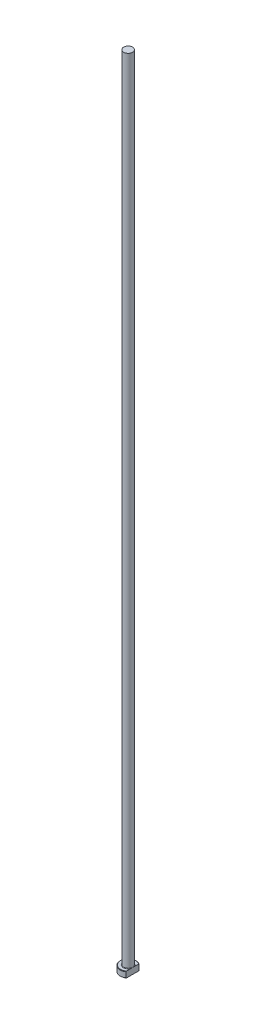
ISO-10303-21;
HEADER;
FILE_DESCRIPTION(('STEP AP214'),'2;1');
FILE_NAME('part.step','',(''),(''),'','','');
FILE_SCHEMA(('AUTOMOTIVE_DESIGN { 1 0 10303 214 1 1 1 1 }'));
ENDSEC;
DATA;
#1=APPLICATION_CONTEXT('core data for automotive mechanical design processes');
#2=APPLICATION_PROTOCOL_DEFINITION('international standard','automotive_design',2000,#1);
#3=PRODUCT_CONTEXT('',#1,'mechanical');
#4=PRODUCT('Part','Part','',(#3));
#5=PRODUCT_RELATED_PRODUCT_CATEGORY('part','',(#4));
#6=PRODUCT_DEFINITION_FORMATION('','',#4);
#7=PRODUCT_DEFINITION_CONTEXT('part definition',#1,'design');
#8=PRODUCT_DEFINITION('design','',#6,#7);
#9=PRODUCT_DEFINITION_SHAPE('','',#8);
#10=(LENGTH_UNIT() NAMED_UNIT(*) SI_UNIT(.MILLI.,.METRE.));
#11=(NAMED_UNIT(*) PLANE_ANGLE_UNIT() SI_UNIT($,.RADIAN.));
#12=(NAMED_UNIT(*) SI_UNIT($,.STERADIAN.) SOLID_ANGLE_UNIT());
#13=UNCERTAINTY_MEASURE_WITH_UNIT(LENGTH_MEASURE(1.E-05),#10,'distance_accuracy_value','');
#14=(GEOMETRIC_REPRESENTATION_CONTEXT(3) GLOBAL_UNCERTAINTY_ASSIGNED_CONTEXT((#13)) GLOBAL_UNIT_ASSIGNED_CONTEXT((#10,
#11,#12)) REPRESENTATION_CONTEXT('',''));
#15=CARTESIAN_POINT('',(0.,0.,0.));
#16=DIRECTION('',(0.,0.,1.));
#17=DIRECTION('',(1.,0.,0.));
#18=AXIS2_PLACEMENT_3D('',#15,#16,#17);
#19=CARTESIAN_POINT('',(0.,0.,0.));
#20=DIRECTION('',(0.,-1.,0.));
#21=DIRECTION('',(0.,0.,-1.));
#22=AXIS2_PLACEMENT_3D('',#19,#20,#21);
#23=PLANE('',#22);
#24=CARTESIAN_POINT('',(0.,0.,0.));
#25=DIRECTION('',(0.,-1.,0.));
#26=DIRECTION('',(0.,0.,-1.));
#27=AXIS2_PLACEMENT_3D('',#24,#25,#26);
#28=CIRCLE('',#27,3.80000000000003);
#29=CARTESIAN_POINT('',(2.24999999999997,0.,3.06227039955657));
#30=VERTEX_POINT('',#29);
#31=CARTESIAN_POINT('',(2.24999999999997,0.,-3.06227039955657));
#32=VERTEX_POINT('',#31);
#33=EDGE_CURVE('E98',#30,#32,#28,.T.);
#34=ORIENTED_EDGE('',*,*,#33,.T.);
#35=DIRECTION('',(0.,0.,1.));
#36=VECTOR('',#35,1.);
#37=CARTESIAN_POINT('',(2.24999999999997,0.,-3.30718913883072));
#38=LINE('',#37,#36);
#39=EDGE_CURVE('E83',#32,#30,#38,.T.);
#40=ORIENTED_EDGE('',*,*,#39,.T.);
#41=EDGE_LOOP('',(#34,#40));
#42=FACE_BOUND('',#41,.T.);
#43=ADVANCED_FACE('F32',(#42),#23,.T.);
#44=CARTESIAN_POINT('',(0.,259.958771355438,0.));
#45=DIRECTION('',(0.,1.,0.));
#46=DIRECTION('',(0.,0.,1.));
#47=AXIS2_PLACEMENT_3D('',#44,#45,#46);
#48=CYLINDRICAL_SURFACE('',#47,3.99999999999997);
#49=CARTESIAN_POINT('',(0.,2.80000000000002,0.));
#50=DIRECTION('',(0.,1.,0.));
#51=DIRECTION('',(0.,0.,1.));
#52=AXIS2_PLACEMENT_3D('',#49,#50,#51);
#53=CIRCLE('',#52,3.99999999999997);
#54=CARTESIAN_POINT('',(2.24999999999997,2.80000000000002,3.30718913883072));
#55=VERTEX_POINT('',#54);
#56=CARTESIAN_POINT('',(2.24999999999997,2.80000000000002,-3.30718913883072));
#57=VERTEX_POINT('',#56);
#58=EDGE_CURVE('E104',#55,#57,#53,.F.);
#59=ORIENTED_EDGE('',*,*,#58,.T.);
#60=DIRECTION('',(0.,-1.,0.));
#61=VECTOR('',#60,1.);
#62=CARTESIAN_POINT('',(2.24999999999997,400.,-3.30718913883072));
#63=LINE('',#62,#61);
#64=CARTESIAN_POINT('',(2.24999999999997,0.199999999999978,-3.30718913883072));
#65=VERTEX_POINT('',#64);
#66=EDGE_CURVE('E183',#57,#65,#63,.T.);
#67=ORIENTED_EDGE('',*,*,#66,.T.);
#68=CARTESIAN_POINT('',(0.,0.199999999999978,0.));
#69=DIRECTION('',(0.,-1.,0.));
#70=DIRECTION('',(0.,0.,-1.));
#71=AXIS2_PLACEMENT_3D('',#68,#69,#70);
#72=CIRCLE('',#71,3.99999999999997);
#73=CARTESIAN_POINT('',(2.24999999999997,0.199999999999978,3.30718913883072));
#74=VERTEX_POINT('',#73);
#75=EDGE_CURVE('E100',#65,#74,#72,.F.);
#76=ORIENTED_EDGE('',*,*,#75,.T.);
#77=DIRECTION('',(0.,-1.,0.));
#78=VECTOR('',#77,1.);
#79=CARTESIAN_POINT('',(2.24999999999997,400.,3.30718913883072));
#80=LINE('',#79,#78);
#81=EDGE_CURVE('E93',#55,#74,#80,.T.);
#82=ORIENTED_EDGE('',*,*,#81,.F.);
#83=EDGE_LOOP('',(#59,#67,#76,#82));
#84=FACE_BOUND('',#83,.T.);
#85=ADVANCED_FACE('F158',(#84),#48,.T.);
#86=CARTESIAN_POINT('',(-3.99999999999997,3.,0.));
#87=DIRECTION('',(0.,1.,0.));
#88=DIRECTION('',(0.,0.,1.));
#89=AXIS2_PLACEMENT_3D('',#86,#87,#88);
#90=PLANE('',#89);
#91=CARTESIAN_POINT('',(0.,3.,0.));
#92=DIRECTION('',(0.,1.,0.));
#93=DIRECTION('',(0.,0.,1.));
#94=AXIS2_PLACEMENT_3D('',#91,#92,#93);
#95=CIRCLE('',#94,3.80000000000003);
#96=CARTESIAN_POINT('',(2.24999999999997,3.,-3.06227039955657));
#97=VERTEX_POINT('',#96);
#98=CARTESIAN_POINT('',(2.24999999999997,3.,3.06227039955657));
#99=VERTEX_POINT('',#98);
#100=EDGE_CURVE('E178',#97,#99,#95,.T.);
#101=ORIENTED_EDGE('',*,*,#100,.T.);
#102=DIRECTION('',(0.,0.,-1.));
#103=VECTOR('',#102,1.);
#104=CARTESIAN_POINT('',(2.24999999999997,3.,0.));
#105=LINE('',#104,#103);
#106=CARTESIAN_POINT('',(2.24999999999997,2.99999999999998,0.969535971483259));
#107=VERTEX_POINT('',#106);
#108=EDGE_CURVE('E57',#99,#107,#105,.T.);
#109=ORIENTED_EDGE('',*,*,#108,.T.);
#110=CARTESIAN_POINT('',(0.,3.,0.));
#111=DIRECTION('',(0.,1.,0.));
#112=DIRECTION('',(0.,0.,1.));
#113=AXIS2_PLACEMENT_3D('',#110,#111,#112);
#114=CIRCLE('',#113,2.44999999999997);
#115=CARTESIAN_POINT('',(2.24999999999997,2.99999999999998,-0.969535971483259));
#116=VERTEX_POINT('',#115);
#117=EDGE_CURVE('E107',#107,#116,#114,.F.);
#118=ORIENTED_EDGE('',*,*,#117,.T.);
#119=EDGE_CURVE('E136',#116,#97,#105,.T.);
#120=ORIENTED_EDGE('',*,*,#119,.T.);
#121=EDGE_LOOP('',(#101,#109,#118,#120));
#122=FACE_BOUND('',#121,.T.);
#123=ADVANCED_FACE('F147',(#122),#90,.T.);
#124=CARTESIAN_POINT('',(0.,3.,0.));
#125=DIRECTION('',(0.,-1.,0.));
#126=DIRECTION('',(0.,0.,-1.));
#127=AXIS2_PLACEMENT_3D('',#124,#125,#126);
#128=CONICAL_SURFACE('',#127,3.80000000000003,0.785398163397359);
#129=ORIENTED_EDGE('',*,*,#58,.F.);
#130=CARTESIAN_POINT('',(2.24999999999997,-0.817697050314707,7.27782992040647));
#131=CARTESIAN_POINT('',(2.24999999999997,-0.691332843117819,7.14556140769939));
#132=CARTESIAN_POINT('',(2.24999999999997,-0.565122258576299,7.01314597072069));
#133=CARTESIAN_POINT('',(2.24999999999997,-0.31307114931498,6.74796170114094));
#134=CARTESIAN_POINT('',(2.24999999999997,-0.187230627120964,6.61519286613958));
#135=CARTESIAN_POINT('',(2.24999999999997,0.189705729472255,6.21619905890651));
#136=CARTESIAN_POINT('',(2.24999999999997,0.440149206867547,5.94935693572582));
#137=CARTESIAN_POINT('',(2.24999999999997,0.940260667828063,5.41146981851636));
#138=CARTESIAN_POINT('',(2.24999999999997,1.18991116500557,5.14040850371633));
#139=CARTESIAN_POINT('',(2.24999999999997,1.56140055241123,4.73113683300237));
#140=CARTESIAN_POINT('',(2.24999999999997,1.68472451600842,4.59427552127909));
#141=CARTESIAN_POINT('',(2.24999999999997,1.93009407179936,4.31941326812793));
#142=CARTESIAN_POINT('',(2.24999999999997,2.05213967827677,4.18141233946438));
#143=CARTESIAN_POINT('',(2.24999999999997,2.31419582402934,3.88150807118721));
#144=CARTESIAN_POINT('',(2.24999999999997,2.45391708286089,3.71935099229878));
#145=CARTESIAN_POINT('',(2.24999999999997,2.73025215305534,3.39234412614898));
#146=CARTESIAN_POINT('',(2.24999999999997,2.86686529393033,3.22749377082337));
#147=CARTESIAN_POINT('',(2.24999999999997,3.13534139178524,2.89430849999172));
#148=CARTESIAN_POINT('',(2.24999999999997,3.26721073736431,2.72597879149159));
#149=CARTESIAN_POINT('',(2.24999999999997,3.45966785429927,2.46950762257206));
#150=CARTESIAN_POINT('',(2.24999999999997,3.52291962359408,2.38336821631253));
#151=CARTESIAN_POINT('',(2.24999999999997,3.64714184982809,2.2094641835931));
#152=CARTESIAN_POINT('',(2.24999999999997,3.7081125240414,2.12169971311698));
#153=CARTESIAN_POINT('',(2.24999999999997,3.82102230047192,1.95327886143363));
#154=CARTESIAN_POINT('',(2.24999999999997,3.87324695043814,1.87281476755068));
#155=CARTESIAN_POINT('',(2.24999999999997,3.97467249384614,1.70998172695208));
#156=CARTESIAN_POINT('',(2.24999999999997,4.02387305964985,1.62761257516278));
#157=CARTESIAN_POINT('',(2.24999999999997,4.11837607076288,1.46059799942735));
#158=CARTESIAN_POINT('',(2.24999999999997,4.16367708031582,1.37595175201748));
#159=CARTESIAN_POINT('',(2.24999999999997,4.24914050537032,1.20413766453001));
#160=CARTESIAN_POINT('',(2.24999999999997,4.28930406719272,1.11697039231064));
#161=CARTESIAN_POINT('',(2.24999999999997,4.38314726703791,0.891175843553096));
#162=CARTESIAN_POINT('',(2.24999999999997,4.43219749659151,0.750488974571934));
#163=CARTESIAN_POINT('',(2.24999999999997,4.48826674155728,0.535159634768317));
#164=CARTESIAN_POINT('',(2.24999999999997,4.50402844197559,0.462776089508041));
#165=CARTESIAN_POINT('',(2.24999999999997,4.52893388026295,0.316860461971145));
#166=CARTESIAN_POINT('',(2.24999999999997,4.53807847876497,0.243328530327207));
#167=CARTESIAN_POINT('',(2.24999999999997,4.54922474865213,0.0949504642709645));
#168=CARTESIAN_POINT('',(2.24999999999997,4.55115152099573,0.0200986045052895));
#169=CARTESIAN_POINT('',(2.24999999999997,4.54752076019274,-0.129420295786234));
#170=CARTESIAN_POINT('',(2.24999999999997,4.54196316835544,-0.204087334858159));
#171=CARTESIAN_POINT('',(2.24999999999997,4.52372329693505,-0.352688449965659));
#172=CARTESIAN_POINT('',(2.24999999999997,4.51102617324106,-0.426620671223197));
#173=CARTESIAN_POINT('',(2.24999999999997,4.47926333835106,-0.573094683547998));
#174=CARTESIAN_POINT('',(2.24999999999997,4.46019612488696,-0.645636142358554));
#175=CARTESIAN_POINT('',(2.24999999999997,4.40610994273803,-0.823701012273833));
#176=CARTESIAN_POINT('',(2.24999999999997,4.36783449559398,-0.928230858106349));
#177=CARTESIAN_POINT('',(2.24999999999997,4.28232692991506,-1.13354070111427));
#178=CARTESIAN_POINT('',(2.24999999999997,4.23508812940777,-1.23431783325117));
#179=CARTESIAN_POINT('',(2.24999999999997,4.13380125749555,-1.43298762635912));
#180=CARTESIAN_POINT('',(2.24999999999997,4.07972026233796,-1.53086330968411));
#181=CARTESIAN_POINT('',(2.24999999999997,3.9949620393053,-1.67548648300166));
#182=CARTESIAN_POINT('',(2.24999999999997,3.96610811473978,-1.72332162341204));
#183=CARTESIAN_POINT('',(2.24999999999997,3.90734436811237,-1.81833709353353));
#184=CARTESIAN_POINT('',(2.24999999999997,3.87743458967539,-1.86551745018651));
#185=CARTESIAN_POINT('',(2.24999999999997,3.7750959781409,-2.02354622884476));
#186=CARTESIAN_POINT('',(2.24999999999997,3.70057106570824,-2.13303820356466));
#187=CARTESIAN_POINT('',(2.24999999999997,3.54784662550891,-2.34943854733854));
#188=CARTESIAN_POINT('',(2.24999999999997,3.46964624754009,-2.45634630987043));
#189=CARTESIAN_POINT('',(2.24999999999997,3.31046802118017,-2.66818697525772));
#190=CARTESIAN_POINT('',(2.24999999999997,3.22948822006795,-2.77311840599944));
#191=CARTESIAN_POINT('',(2.24999999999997,3.06545223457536,-2.98134898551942));
#192=CARTESIAN_POINT('',(2.24999999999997,2.98239592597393,-3.08464803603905));
#193=CARTESIAN_POINT('',(2.24999999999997,2.7304425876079,-3.39308007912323));
#194=CARTESIAN_POINT('',(2.24999999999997,2.55914389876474,-3.59624854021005));
#195=CARTESIAN_POINT('',(2.24999999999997,2.21260420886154,-3.99901521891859));
#196=CARTESIAN_POINT('',(2.24999999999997,2.03736490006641,-4.19861490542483));
#197=CARTESIAN_POINT('',(2.24999999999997,1.68403823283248,-4.59551245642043));
#198=CARTESIAN_POINT('',(2.24999999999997,1.50594904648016,-4.79280869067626));
#199=CARTESIAN_POINT('',(2.24999999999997,1.14782580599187,-5.18566037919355));
#200=CARTESIAN_POINT('',(2.24999999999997,0.967791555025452,-5.38121565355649));
#201=CARTESIAN_POINT('',(2.24999999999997,0.606519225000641,-5.77078870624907));
#202=CARTESIAN_POINT('',(2.24999999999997,0.425282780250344,-5.96480800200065));
#203=CARTESIAN_POINT('',(2.24999999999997,0.0617463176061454,-6.35184762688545));
#204=CARTESIAN_POINT('',(2.24999999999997,-0.120553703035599,-6.5448679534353));
#205=CARTESIAN_POINT('',(2.24999999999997,-0.38887673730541,-6.82775668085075));
#206=CARTESIAN_POINT('',(2.24999999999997,-0.474578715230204,-6.91792994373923));
#207=CARTESIAN_POINT('',(2.24999999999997,-0.64606226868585,-7.09803491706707));
#208=CARTESIAN_POINT('',(2.24999999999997,-0.731843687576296,-7.1879667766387));
#209=CARTESIAN_POINT('',(2.24999999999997,-0.817697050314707,-7.27782992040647));
#210=B_SPLINE_CURVE_WITH_KNOTS('',3,(#130,#131,#132,#133,#134,#135,#136,#137,#138,#139,#140,
#141,#142,#143,#144,#145,#146,#147,#148,#149,#150,#151,#152,#153,#154,#155,#156,#157,#158,#159,
#160,#161,#162,#163,#164,#165,#166,#167,#168,#169,#170,#171,#172,#173,#174,#175,#176,#177,#178,
#179,#180,#181,#182,#183,#184,#185,#186,#187,#188,#189,#190,#191,#192,#193,#194,#195,#196,#197,
#198,#199,#200,#201,#202,#203,#204,#205,#206,#207,#208,#209),.UNSPECIFIED.,.F.,.F.,(4,2,2,2,2,2,
2,2,2,2,2,2,2,2,2,2,2,2,2,2,2,2,2,2,2,2,2,2,2,2,2,2,2,2,2,2,2,2,2,4),(0.,0.548785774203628,
1.09757528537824,2.19544562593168,3.30094607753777,3.85362276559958,4.40629327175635,
5.04841012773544,5.69066421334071,6.33201824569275,6.65259523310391,6.9731416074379,
7.26086761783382,7.54862474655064,7.83648737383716,8.12428565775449,8.56956070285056,
8.7915473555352,9.01350513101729,9.23775987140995,9.46201637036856,9.68674086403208,
9.91151839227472,10.2448678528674,10.5784668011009,10.9137368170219,11.0813178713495,
11.2488920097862,11.6461164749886,12.0434332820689,12.4410351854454,12.8386609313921,
13.6357991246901,14.4326012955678,15.2299368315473,16.0273538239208,16.8238479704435,
17.6203441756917,17.993552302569,18.3664002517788),.UNSPECIFIED.);
#211=EDGE_CURVE('E135',#55,#99,#210,.T.);
#212=ORIENTED_EDGE('',*,*,#211,.T.);
#213=ORIENTED_EDGE('',*,*,#100,.F.);
#214=EDGE_CURVE('E127',#97,#57,#210,.T.);
#215=ORIENTED_EDGE('',*,*,#214,.T.);
#216=EDGE_LOOP('',(#129,#212,#213,#215));
#217=FACE_BOUND('',#216,.T.);
#218=ADVANCED_FACE('F143',(#217),#128,.T.);
#219=CARTESIAN_POINT('',(0.,0.199999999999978,0.));
#220=DIRECTION('',(0.,1.,0.));
#221=DIRECTION('',(0.,0.,1.));
#222=AXIS2_PLACEMENT_3D('',#219,#220,#221);
#223=CONICAL_SURFACE('',#222,3.99999999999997,0.785398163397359);
#224=ORIENTED_EDGE('',*,*,#75,.F.);
#225=CARTESIAN_POINT('',(2.24999999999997,3.81769705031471,-7.27782992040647));
#226=CARTESIAN_POINT('',(2.24999999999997,3.69133284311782,-7.14556140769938));
#227=CARTESIAN_POINT('',(2.24999999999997,3.5651222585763,-7.01314597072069));
#228=CARTESIAN_POINT('',(2.24999999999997,3.31307114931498,-6.74796170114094));
#229=CARTESIAN_POINT('',(2.24999999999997,3.18723062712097,-6.61519286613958));
#230=CARTESIAN_POINT('',(2.24999999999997,2.81029427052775,-6.21619905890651));
#231=CARTESIAN_POINT('',(2.24999999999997,2.55985079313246,-5.94935693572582));
#232=CARTESIAN_POINT('',(2.24999999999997,2.05973933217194,-5.41146981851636));
#233=CARTESIAN_POINT('',(2.24999999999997,1.81008883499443,-5.14040850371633));
#234=CARTESIAN_POINT('',(2.24999999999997,1.43859944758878,-4.73113683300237));
#235=CARTESIAN_POINT('',(2.24999999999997,1.31527548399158,-4.59427552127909));
#236=CARTESIAN_POINT('',(2.24999999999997,1.06990592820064,-4.31941326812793));
#237=CARTESIAN_POINT('',(2.24999999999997,0.947860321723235,-4.18141233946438));
#238=CARTESIAN_POINT('',(2.24999999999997,0.685804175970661,-3.88150807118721));
#239=CARTESIAN_POINT('',(2.24999999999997,0.54608291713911,-3.71935099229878));
#240=CARTESIAN_POINT('',(2.24999999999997,0.269747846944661,-3.39234412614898));
#241=CARTESIAN_POINT('',(2.24999999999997,0.133134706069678,-3.22749377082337));
#242=CARTESIAN_POINT('',(2.24999999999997,-0.135341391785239,-2.89430849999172));
#243=CARTESIAN_POINT('',(2.24999999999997,-0.267210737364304,-2.72597879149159));
#244=CARTESIAN_POINT('',(2.24999999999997,-0.459667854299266,-2.46950762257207));
#245=CARTESIAN_POINT('',(2.24999999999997,-0.522919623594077,-2.38336821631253));
#246=CARTESIAN_POINT('',(2.24999999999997,-0.64714184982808,-2.20946418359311));
#247=CARTESIAN_POINT('',(2.24999999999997,-0.708112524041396,-2.12169971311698));
#248=CARTESIAN_POINT('',(2.24999999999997,-0.821022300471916,-1.95327886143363));
#249=CARTESIAN_POINT('',(2.24999999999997,-0.873246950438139,-1.87281476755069));
#250=CARTESIAN_POINT('',(2.24999999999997,-0.974672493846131,-1.70998172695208));
#251=CARTESIAN_POINT('',(2.24999999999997,-1.02387305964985,-1.62761257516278));
#252=CARTESIAN_POINT('',(2.24999999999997,-1.11837607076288,-1.46059799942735));
#253=CARTESIAN_POINT('',(2.24999999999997,-1.16367708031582,-1.37595175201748));
#254=CARTESIAN_POINT('',(2.24999999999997,-1.24914050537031,-1.20413766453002));
#255=CARTESIAN_POINT('',(2.24999999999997,-1.28930406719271,-1.11697039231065));
#256=CARTESIAN_POINT('',(2.24999999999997,-1.3831472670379,-0.891175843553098));
#257=CARTESIAN_POINT('',(2.24999999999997,-1.4321974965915,-0.750488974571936));
#258=CARTESIAN_POINT('',(2.24999999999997,-1.48826674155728,-0.535159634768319));
#259=CARTESIAN_POINT('',(2.24999999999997,-1.50402844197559,-0.462776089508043));
#260=CARTESIAN_POINT('',(2.24999999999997,-1.52893388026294,-0.316860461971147));
#261=CARTESIAN_POINT('',(2.24999999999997,-1.53807847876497,-0.243328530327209));
#262=CARTESIAN_POINT('',(2.24999999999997,-1.54922474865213,-0.0949504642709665));
#263=CARTESIAN_POINT('',(2.24999999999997,-1.55115152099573,-0.0200986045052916));
#264=CARTESIAN_POINT('',(2.24999999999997,-1.54752076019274,0.129420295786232));
#265=CARTESIAN_POINT('',(2.24999999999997,-1.54196316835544,0.204087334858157));
#266=CARTESIAN_POINT('',(2.24999999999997,-1.52372329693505,0.352688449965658));
#267=CARTESIAN_POINT('',(2.24999999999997,-1.51102617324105,0.426620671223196));
#268=CARTESIAN_POINT('',(2.24999999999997,-1.47926333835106,0.573094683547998));
#269=CARTESIAN_POINT('',(2.24999999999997,-1.46019612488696,0.645636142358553));
#270=CARTESIAN_POINT('',(2.24999999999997,-1.40610994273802,0.823701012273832));
#271=CARTESIAN_POINT('',(2.24999999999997,-1.36783449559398,0.928230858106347));
#272=CARTESIAN_POINT('',(2.24999999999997,-1.28232692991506,1.13354070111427));
#273=CARTESIAN_POINT('',(2.24999999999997,-1.23508812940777,1.23431783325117));
#274=CARTESIAN_POINT('',(2.24999999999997,-1.13380125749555,1.43298762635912));
#275=CARTESIAN_POINT('',(2.24999999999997,-1.07972026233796,1.53086330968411));
#276=CARTESIAN_POINT('',(2.24999999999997,-0.994962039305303,1.67548648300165));
#277=CARTESIAN_POINT('',(2.24999999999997,-0.966108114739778,1.72332162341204));
#278=CARTESIAN_POINT('',(2.24999999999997,-0.907344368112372,1.81833709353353));
#279=CARTESIAN_POINT('',(2.24999999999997,-0.877434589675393,1.86551745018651));
#280=CARTESIAN_POINT('',(2.24999999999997,-0.775095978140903,2.02354622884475));
#281=CARTESIAN_POINT('',(2.24999999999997,-0.700571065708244,2.13303820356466));
#282=CARTESIAN_POINT('',(2.24999999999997,-0.547846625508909,2.34943854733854));
#283=CARTESIAN_POINT('',(2.24999999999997,-0.469646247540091,2.45634630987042));
#284=CARTESIAN_POINT('',(2.24999999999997,-0.310468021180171,2.66818697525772));
#285=CARTESIAN_POINT('',(2.24999999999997,-0.229488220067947,2.77311840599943));
#286=CARTESIAN_POINT('',(2.24999999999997,-0.0654522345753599,2.98134898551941));
#287=CARTESIAN_POINT('',(2.24999999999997,0.0176040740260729,3.08464803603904));
#288=CARTESIAN_POINT('',(2.24999999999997,0.269557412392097,3.39308007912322));
#289=CARTESIAN_POINT('',(2.24999999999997,0.440856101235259,3.59624854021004));
#290=CARTESIAN_POINT('',(2.24999999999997,0.787395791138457,3.99901521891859));
#291=CARTESIAN_POINT('',(2.24999999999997,0.962635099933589,4.19861490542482));
#292=CARTESIAN_POINT('',(2.24999999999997,1.31596176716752,4.59551245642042));
#293=CARTESIAN_POINT('',(2.24999999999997,1.49405095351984,4.79280869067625));
#294=CARTESIAN_POINT('',(2.24999999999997,1.85217419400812,5.18566037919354));
#295=CARTESIAN_POINT('',(2.24999999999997,2.03220844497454,5.38121565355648));
#296=CARTESIAN_POINT('',(2.24999999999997,2.39348077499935,5.77078870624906));
#297=CARTESIAN_POINT('',(2.24999999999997,2.57471721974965,5.96480800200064));
#298=CARTESIAN_POINT('',(2.24999999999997,2.93825368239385,6.35184762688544));
#299=CARTESIAN_POINT('',(2.24999999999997,3.12055370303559,6.54486795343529));
#300=CARTESIAN_POINT('',(2.24999999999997,3.3888767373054,6.82775668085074));
#301=CARTESIAN_POINT('',(2.24999999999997,3.4745787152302,6.91792994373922));
#302=CARTESIAN_POINT('',(2.24999999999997,3.64606226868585,7.09803491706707));
#303=CARTESIAN_POINT('',(2.24999999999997,3.7318436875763,7.1879667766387));
#304=CARTESIAN_POINT('',(2.24999999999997,3.81769705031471,7.27782992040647));
#305=B_SPLINE_CURVE_WITH_KNOTS('',3,(#225,#226,#227,#228,#229,#230,#231,#232,#233,#234,#235,
#236,#237,#238,#239,#240,#241,#242,#243,#244,#245,#246,#247,#248,#249,#250,#251,#252,#253,#254,
#255,#256,#257,#258,#259,#260,#261,#262,#263,#264,#265,#266,#267,#268,#269,#270,#271,#272,#273,
#274,#275,#276,#277,#278,#279,#280,#281,#282,#283,#284,#285,#286,#287,#288,#289,#290,#291,#292,
#293,#294,#295,#296,#297,#298,#299,#300,#301,#302,#303,#304),.UNSPECIFIED.,.F.,.F.,(4,2,2,2,2,2,
2,2,2,2,2,2,2,2,2,2,2,2,2,2,2,2,2,2,2,2,2,2,2,2,2,2,2,2,2,2,2,2,2,4),(0.,0.548785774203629,
1.09757528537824,2.19544562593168,3.30094607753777,3.85362276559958,4.40629327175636,
5.04841012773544,5.69066421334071,6.33201824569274,6.65259523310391,6.97314160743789,
7.26086761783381,7.54862474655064,7.83648737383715,8.12428565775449,8.56956070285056,
8.7915473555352,9.01350513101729,9.23775987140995,9.46201637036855,9.68674086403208,
9.91151839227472,10.2448678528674,10.5784668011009,10.9137368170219,11.0813178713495,
11.2488920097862,11.6461164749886,12.0434332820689,12.4410351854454,12.838660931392,
13.63579912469,14.4326012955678,15.2299368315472,16.0273538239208,16.8238479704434,
17.6203441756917,17.9935523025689,18.3664002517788),.UNSPECIFIED.);
#306=EDGE_CURVE('E86',#65,#32,#305,.T.);
#307=ORIENTED_EDGE('',*,*,#306,.T.);
#308=ORIENTED_EDGE('',*,*,#33,.F.);
#309=EDGE_CURVE('E89',#30,#74,#305,.T.);
#310=ORIENTED_EDGE('',*,*,#309,.T.);
#311=EDGE_LOOP('',(#224,#307,#308,#310));
#312=FACE_BOUND('',#311,.T.);
#313=ADVANCED_FACE('F97',(#312),#223,.T.);
#314=CARTESIAN_POINT('',(0.,3.19999999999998,0.));
#315=DIRECTION('',(0.,1.,0.));
#316=DIRECTION('',(0.,0.,1.));
#317=AXIS2_PLACEMENT_3D('',#314,#315,#316);
#318=TOROIDAL_SURFACE('',#317,2.44999999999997,0.2);
#319=CARTESIAN_POINT('',(2.24999999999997,3.19999999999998,0.));
#320=CARTESIAN_POINT('',(2.24999999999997,3.20000050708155,6.44724205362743E-11));
#321=CARTESIAN_POINT('',(2.24999999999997,3.20000101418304,-1.58891187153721E-07));
#322=CARTESIAN_POINT('',(2.24999999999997,3.20000197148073,-6.21779237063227E-07));
#323=CARTESIAN_POINT('',(2.24999999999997,3.20000241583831,-9.3446075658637E-07));
#324=CARTESIAN_POINT('',(2.24999999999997,3.20000332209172,-1.68105190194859E-06));
#325=CARTESIAN_POINT('',(2.24999999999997,3.20000377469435,-2.12646372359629E-06));
#326=CARTESIAN_POINT('',(2.24999999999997,3.20000460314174,-3.06333876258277E-06));
#327=CARTESIAN_POINT('',(2.24999999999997,3.20000498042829,-3.55360517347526E-06));
#328=CARTESIAN_POINT('',(2.24999999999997,3.20000633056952,-5.39956008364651E-06));
#329=CARTESIAN_POINT('',(2.24999999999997,3.20000722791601,-6.8123761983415E-06));
#330=CARTESIAN_POINT('',(2.24999999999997,3.200008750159,-9.65315882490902E-06));
#331=CARTESIAN_POINT('',(2.24999999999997,3.2000093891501,-1.10739426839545E-05));
#332=CARTESIAN_POINT('',(2.24999999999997,3.20001197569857,-1.69289386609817E-05));
#333=CARTESIAN_POINT('',(2.24999999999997,3.2000138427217,-2.1402980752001E-05));
#334=CARTESIAN_POINT('',(2.24999999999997,3.20001668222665,-2.99701699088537E-05));
#335=CARTESIAN_POINT('',(2.24999999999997,3.20001774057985,-3.40349906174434E-05));
#336=CARTESIAN_POINT('',(2.24999999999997,3.20002529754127,-6.37611258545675E-05));
#337=CARTESIAN_POINT('',(2.24999999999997,3.20003087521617,-8.9609528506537E-05));
#338=CARTESIAN_POINT('',(2.24999999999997,3.20005527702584,-0.000191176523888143));
#339=CARTESIAN_POINT('',(2.24999999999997,3.20007870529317,-0.000265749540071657));
#340=CARTESIAN_POINT('',(2.24999999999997,3.2001693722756,-0.000559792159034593));
#341=CARTESIAN_POINT('',(2.24999999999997,3.2002335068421,-0.000779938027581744));
#342=CARTESIAN_POINT('',(2.24999999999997,3.20048920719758,-0.00165050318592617));
#343=CARTESIAN_POINT('',(2.24999999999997,3.20068459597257,-0.00230007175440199));
#344=CARTESIAN_POINT('',(2.24999999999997,3.20149322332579,-0.00499620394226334));
#345=CARTESIAN_POINT('',(2.24999999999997,3.20210170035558,-0.00704382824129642));
#346=CARTESIAN_POINT('',(2.24999999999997,3.20797104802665,-0.0267853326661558));
#347=CARTESIAN_POINT('',(2.24999999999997,3.21325284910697,-0.0444747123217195));
#348=CARTESIAN_POINT('',(2.24999999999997,3.22356918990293,-0.0791736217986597));
#349=CARTESIAN_POINT('',(2.24999999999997,3.22860532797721,-0.0961827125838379));
#350=CARTESIAN_POINT('',(2.24999999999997,3.23925368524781,-0.132326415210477));
#351=CARTESIAN_POINT('',(2.24999999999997,3.24485983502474,-0.151462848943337));
#352=CARTESIAN_POINT('',(2.24999999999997,3.25603662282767,-0.18996857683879));
#353=CARTESIAN_POINT('',(2.24999999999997,3.26160623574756,-0.209338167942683));
#354=CARTESIAN_POINT('',(2.24999999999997,3.27500311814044,-0.25652385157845));
#355=CARTESIAN_POINT('',(2.24999999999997,3.28276182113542,-0.284359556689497));
#356=CARTESIAN_POINT('',(2.24999999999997,3.29771346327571,-0.339425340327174));
#357=CARTESIAN_POINT('',(2.24999999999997,3.30491576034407,-0.36665287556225));
#358=CARTESIAN_POINT('',(2.24999999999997,3.32240345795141,-0.43509070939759));
#359=CARTESIAN_POINT('',(2.24999999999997,3.33239618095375,-0.476377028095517));
#360=CARTESIAN_POINT('',(2.24999999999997,3.35100390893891,-0.559624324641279));
#361=CARTESIAN_POINT('',(2.24999999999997,3.3596067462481,-0.601588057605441));
#362=CARTESIAN_POINT('',(2.24999999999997,3.37543235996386,-0.689258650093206));
#363=CARTESIAN_POINT('',(2.24999999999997,3.38248971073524,-0.73499643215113));
#364=CARTESIAN_POINT('',(2.24999999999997,3.39342529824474,-0.826730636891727));
#365=CARTESIAN_POINT('',(2.24999999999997,3.39731270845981,-0.872725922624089));
#366=CARTESIAN_POINT('',(2.24999999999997,3.40071499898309,-0.963783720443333));
#367=CARTESIAN_POINT('',(2.24999999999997,3.40033773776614,-1.00884048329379));
#368=CARTESIAN_POINT('',(2.24999999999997,3.39535803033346,-1.07577565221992));
#369=CARTESIAN_POINT('',(2.24999999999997,3.39299580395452,-1.09781842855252));
#370=CARTESIAN_POINT('',(2.24999999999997,3.38649339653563,-1.14163100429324));
#371=CARTESIAN_POINT('',(2.24999999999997,3.38235512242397,-1.16340107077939));
#372=CARTESIAN_POINT('',(2.24999999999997,3.37178290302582,-1.20664751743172));
#373=CARTESIAN_POINT('',(2.24999999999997,3.36532376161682,-1.2281178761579));
#374=CARTESIAN_POINT('',(2.24999999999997,3.34940253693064,-1.26994619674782));
#375=CARTESIAN_POINT('',(2.24999999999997,3.33994859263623,-1.29030700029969));
#376=CARTESIAN_POINT('',(2.24999999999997,3.32341167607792,-1.3178414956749));
#377=CARTESIAN_POINT('',(2.24999999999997,3.31797729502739,-1.32600125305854));
#378=CARTESIAN_POINT('',(2.24999999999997,3.30618383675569,-1.34165219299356));
#379=CARTESIAN_POINT('',(2.24999999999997,3.29982370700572,-1.34914259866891));
#380=CARTESIAN_POINT('',(2.24999999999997,3.28597385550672,-1.36322511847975));
#381=CARTESIAN_POINT('',(2.24999999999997,3.27846961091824,-1.36980324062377));
#382=CARTESIAN_POINT('',(2.24999999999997,3.26235014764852,-1.3814177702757));
#383=CARTESIAN_POINT('',(2.24999999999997,3.25373945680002,-1.38646019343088));
#384=CARTESIAN_POINT('',(2.24999999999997,3.23893119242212,-1.39291408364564));
#385=CARTESIAN_POINT('',(2.24999999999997,3.23301804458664,-1.39497873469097));
#386=CARTESIAN_POINT('',(2.24999999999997,3.22092968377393,-1.3980973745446));
#387=CARTESIAN_POINT('',(2.24999999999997,3.21475469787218,-1.39915222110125));
#388=CARTESIAN_POINT('',(2.24999999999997,3.20229305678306,-1.4001597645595));
#389=CARTESIAN_POINT('',(2.24999999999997,3.19600609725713,-1.40010876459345));
#390=CARTESIAN_POINT('',(2.24999999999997,3.18353929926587,-1.39890051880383));
#391=CARTESIAN_POINT('',(2.24999999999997,3.17735949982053,-1.39774287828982));
#392=CARTESIAN_POINT('',(2.24999999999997,3.16550896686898,-1.39448677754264));
#393=CARTESIAN_POINT('',(2.24999999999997,3.15982782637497,-1.39242539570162));
#394=CARTESIAN_POINT('',(2.24999999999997,3.14882191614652,-1.38751374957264));
#395=CARTESIAN_POINT('',(2.24999999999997,3.14349727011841,-1.38466321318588));
#396=CARTESIAN_POINT('',(2.24999999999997,3.13026923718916,-1.37647479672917));
#397=CARTESIAN_POINT('',(2.24999999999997,3.12266499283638,-1.37065399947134));
#398=CARTESIAN_POINT('',(2.24999999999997,3.10845647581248,-1.35789458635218));
#399=CARTESIAN_POINT('',(2.24999999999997,3.10185542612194,-1.3509525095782));
#400=CARTESIAN_POINT('',(2.24999999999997,3.0855320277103,-1.33150080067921));
#401=CARTESIAN_POINT('',(2.24999999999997,3.07660573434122,-1.31832816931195));
#402=CARTESIAN_POINT('',(2.24999999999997,3.06078136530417,-1.29086374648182));
#403=CARTESIAN_POINT('',(2.24999999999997,3.05388481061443,-1.27657112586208));
#404=CARTESIAN_POINT('',(2.24999999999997,3.03602738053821,-1.23377116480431));
#405=CARTESIAN_POINT('',(2.24999999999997,3.02722778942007,-1.20437236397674));
#406=CARTESIAN_POINT('',(2.24999999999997,3.01362163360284,-1.14441037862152));
#407=CARTESIAN_POINT('',(2.24999999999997,3.00886464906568,-1.11383741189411));
#408=CARTESIAN_POINT('',(2.24999999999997,3.00105881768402,-1.03966563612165));
#409=CARTESIAN_POINT('',(2.24999999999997,2.99953171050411,-0.995912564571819));
#410=CARTESIAN_POINT('',(2.24999999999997,3.00070174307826,-0.908367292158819));
#411=CARTESIAN_POINT('',(2.24999999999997,3.00341475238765,-0.864575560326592));
#412=CARTESIAN_POINT('',(2.24999999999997,3.01171554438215,-0.779778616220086));
#413=CARTESIAN_POINT('',(2.24999999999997,3.01713219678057,-0.738755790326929));
#414=CARTESIAN_POINT('',(2.24999999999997,3.03001638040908,-0.657360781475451));
#415=CARTESIAN_POINT('',(2.24999999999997,3.03746816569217,-0.616986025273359));
#416=CARTESIAN_POINT('',(2.24999999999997,3.05405724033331,-0.535981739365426));
#417=CARTESIAN_POINT('',(2.24999999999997,3.06321733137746,-0.495356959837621));
#418=CARTESIAN_POINT('',(2.24999999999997,3.0829739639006,-0.413374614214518));
#419=CARTESIAN_POINT('',(2.24999999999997,3.09360096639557,-0.372024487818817));
#420=CARTESIAN_POINT('',(2.24999999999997,3.11230155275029,-0.302306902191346));
#421=CARTESIAN_POINT('',(2.24999999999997,3.12014883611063,-0.273877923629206));
#422=CARTESIAN_POINT('',(2.24999999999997,3.1360590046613,-0.21741165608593));
#423=CARTESIAN_POINT('',(2.24999999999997,3.14411864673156,-0.189373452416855));
#424=CARTESIAN_POINT('',(2.24999999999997,3.15951571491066,-0.136466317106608));
#425=CARTESIAN_POINT('',(2.24999999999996,3.16683378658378,-0.111591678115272));
#426=CARTESIAN_POINT('',(2.24999999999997,3.18187191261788,-0.0608432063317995));
#427=CARTESIAN_POINT('',(2.24999999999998,3.18959608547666,-0.0349705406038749));
#428=CARTESIAN_POINT('',(2.24999999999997,3.19789887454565,-0.00704171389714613));
#429=CARTESIAN_POINT('',(2.24999999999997,3.19850801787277,-0.00499199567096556));
#430=CARTESIAN_POINT('',(2.24999999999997,3.19931680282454,-0.00229537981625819));
#431=CARTESIAN_POINT('',(2.24999999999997,3.19951170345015,-0.00164742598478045));
#432=CARTESIAN_POINT('',(2.24999999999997,3.19976680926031,-0.000778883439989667));
#433=CARTESIAN_POINT('',(2.24999999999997,3.19983082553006,-0.000559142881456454));
#434=CARTESIAN_POINT('',(2.24999999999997,3.19992134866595,-0.000265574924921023));
#435=CARTESIAN_POINT('',(2.24999999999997,3.19994475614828,-0.000191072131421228));
#436=CARTESIAN_POINT('',(2.24999999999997,3.19996913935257,-8.958673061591E-05));
#437=CARTESIAN_POINT('',(2.24999999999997,3.19997471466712,-6.37485903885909E-05));
#438=CARTESIAN_POINT('',(2.24999999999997,3.19998226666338,-3.40328341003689E-05));
#439=CARTESIAN_POINT('',(2.24999999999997,3.19998332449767,-2.9968622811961E-05));
#440=CARTESIAN_POINT('',(2.24999999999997,3.1999861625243,-2.14026473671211E-05));
#441=CARTESIAN_POINT('',(2.24999999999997,3.19998802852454,-1.69291778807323E-05));
#442=CARTESIAN_POINT('',(2.24999999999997,3.19999061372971,-1.10747627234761E-05));
#443=CARTESIAN_POINT('',(2.24999999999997,3.19999125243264,-9.65402443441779E-06));
#444=CARTESIAN_POINT('',(2.24999999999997,3.19999277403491,-6.81328214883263E-06));
#445=CARTESIAN_POINT('',(2.24999999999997,3.19999367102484,-5.40045583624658E-06));
#446=CARTESIAN_POINT('',(2.24999999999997,3.19999502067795,-3.55442701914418E-06));
#447=CARTESIAN_POINT('',(2.24999999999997,3.19999539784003,-3.06412583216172E-06));
#448=CARTESIAN_POINT('',(2.24999999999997,3.19999622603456,-2.12715879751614E-06));
#449=CARTESIAN_POINT('',(2.24999999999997,3.19999667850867,-1.68168917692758E-06));
#450=CARTESIAN_POINT('',(2.24999999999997,3.19999758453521,-9.34960574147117E-07));
#451=CARTESIAN_POINT('',(2.24999999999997,3.19999802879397,-6.22203835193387E-07));
#452=CARTESIAN_POINT('',(2.24999999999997,3.1999989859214,-1.59128803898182E-07));
#453=CARTESIAN_POINT('',(2.24999999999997,3.19999949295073,-6.44683123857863E-11));
#454=CARTESIAN_POINT('',(2.24999999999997,3.19999999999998,0.));
#455=B_SPLINE_CURVE_WITH_KNOTS('',3,(#319,#320,#321,#322,#323,#324,#325,#326,#327,#328,#329,
#330,#331,#332,#333,#334,#335,#336,#337,#338,#339,#340,#341,#342,#343,#344,#345,#346,#347,#348,
#349,#350,#351,#352,#353,#354,#355,#356,#357,#358,#359,#360,#361,#362,#363,#364,#365,#366,#367,
#368,#369,#370,#371,#372,#373,#374,#375,#376,#377,#378,#379,#380,#381,#382,#383,#384,#385,#386,
#387,#388,#389,#390,#391,#392,#393,#394,#395,#396,#397,#398,#399,#400,#401,#402,#403,#404,#405,
#406,#407,#408,#409,#410,#411,#412,#413,#414,#415,#416,#417,#418,#419,#420,#421,#422,#423,#424,
#425,#426,#427,#428,#429,#430,#431,#432,#433,#434,#435,#436,#437,#438,#439,#440,#441,#442,#443,
#444,#445,#446,#447,#448,#449,#450,#451,#452,#453,#454),.UNSPECIFIED.,.T.,.F.,(4,2,2,2,2,2,2,2,
2,2,2,2,2,2,2,2,2,2,2,2,2,2,2,2,2,2,2,2,2,2,2,2,2,2,2,2,2,2,2,2,2,2,2,2,2,2,2,2,2,2,2,2,2,2,2,2,
2,2,2,2,2,2,2,2,2,2,2,4),(0.,1.52660891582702E-06,3.1524133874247E-06,5.04759848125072E-06,
6.90201355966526E-06,1.19024884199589E-05,1.65722258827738E-05,3.10841862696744E-05,
4.36688554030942E-05,0.000123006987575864,0.000357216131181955,0.00104540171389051,
0.00308000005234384,0.00948876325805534,0.0648698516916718,0.118087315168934,0.177909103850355,
0.238372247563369,0.325060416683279,0.409550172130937,0.53696552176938,0.665442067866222,
0.804194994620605,0.942544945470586,1.0774038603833,1.14385780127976,1.21024056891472,
1.27736693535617,1.34431241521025,1.37367425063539,1.40306973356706,1.432875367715,
1.46256269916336,1.48127715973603,1.49997570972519,1.51873677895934,1.53750454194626,
1.55556541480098,1.57363252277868,1.60219661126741,1.63085061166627,1.67831692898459,
1.72581872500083,1.81736829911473,1.91002510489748,2.04102939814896,2.17252517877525,
2.29658958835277,2.41972004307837,2.54462990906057,2.67269769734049,2.76117244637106,
2.84869182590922,2.92647873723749,3.00747864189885,3.01389398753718,3.01592352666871,
3.016610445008,3.01684443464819,3.01692374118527,3.0169363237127,3.01695083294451,
3.01695550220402,3.01696050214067,3.01696235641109,3.01696425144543,3.01696587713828,
3.01696740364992),.UNSPECIFIED.);
#456=CARTESIAN_POINT('',(2.24999999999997,3.19999999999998,0.));
#457=VERTEX_POINT('',#456);
#458=EDGE_CURVE('E11',#116,#457,#455,.T.);
#459=ORIENTED_EDGE('',*,*,#458,.F.);
#460=ORIENTED_EDGE('',*,*,#117,.F.);
#461=CARTESIAN_POINT('',(2.24999999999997,3.19999999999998,0.));
#462=CARTESIAN_POINT('',(2.24999999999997,3.19999949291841,-6.44723698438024E-11));
#463=CARTESIAN_POINT('',(2.24999999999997,3.19999898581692,1.58891187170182E-07));
#464=CARTESIAN_POINT('',(2.24999999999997,3.19999802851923,6.21779237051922E-07));
#465=CARTESIAN_POINT('',(2.24999999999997,3.19999758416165,9.34460756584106E-07));
#466=CARTESIAN_POINT('',(2.24999999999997,3.19999667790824,1.68105190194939E-06));
#467=CARTESIAN_POINT('',(2.24999999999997,3.19999622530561,2.12646372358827E-06));
#468=CARTESIAN_POINT('',(2.24999999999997,3.19999539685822,3.06333876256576E-06));
#469=CARTESIAN_POINT('',(2.24999999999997,3.19999501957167,3.55360517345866E-06));
#470=CARTESIAN_POINT('',(2.24999999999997,3.19999366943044,5.39956008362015E-06));
#471=CARTESIAN_POINT('',(2.24999999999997,3.19999277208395,6.81237619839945E-06));
#472=CARTESIAN_POINT('',(2.24999999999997,3.19999124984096,9.65315882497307E-06));
#473=CARTESIAN_POINT('',(2.24999999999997,3.19999061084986,1.1073942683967E-05));
#474=CARTESIAN_POINT('',(2.24999999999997,3.19998802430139,1.69289386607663E-05));
#475=CARTESIAN_POINT('',(2.24999999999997,3.19998615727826,2.14029807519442E-05));
#476=CARTESIAN_POINT('',(2.24999999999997,3.19998331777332,2.99701699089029E-05));
#477=CARTESIAN_POINT('',(2.24999999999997,3.19998225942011,3.40349906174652E-05));
#478=CARTESIAN_POINT('',(2.24999999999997,3.19997470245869,6.37611258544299E-05));
#479=CARTESIAN_POINT('',(2.24999999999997,3.19996912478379,8.96095285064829E-05));
#480=CARTESIAN_POINT('',(2.24999999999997,3.19994472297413,0.000191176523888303));
#481=CARTESIAN_POINT('',(2.24999999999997,3.19992129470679,0.00026574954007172));
#482=CARTESIAN_POINT('',(2.24999999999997,3.19983062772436,0.000559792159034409));
#483=CARTESIAN_POINT('',(2.24999999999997,3.19976649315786,0.000779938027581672));
#484=CARTESIAN_POINT('',(2.24999999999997,3.19951079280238,0.00165050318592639));
#485=CARTESIAN_POINT('',(2.24999999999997,3.19931540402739,0.00230007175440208));
#486=CARTESIAN_POINT('',(2.24999999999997,3.19850677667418,0.00499620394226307));
#487=CARTESIAN_POINT('',(2.24999999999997,3.19789829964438,0.0070438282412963));
#488=CARTESIAN_POINT('',(2.24999999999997,3.19202895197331,0.026785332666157));
#489=CARTESIAN_POINT('',(2.24999999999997,3.18674715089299,0.0444747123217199));
#490=CARTESIAN_POINT('',(2.24999999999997,3.17643081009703,0.0791736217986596));
#491=CARTESIAN_POINT('',(2.24999999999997,3.17139467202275,0.0961827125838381));
#492=CARTESIAN_POINT('',(2.24999999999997,3.16074631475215,0.132326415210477));
#493=CARTESIAN_POINT('',(2.24999999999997,3.15514016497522,0.151462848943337));
#494=CARTESIAN_POINT('',(2.24999999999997,3.14396337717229,0.18996857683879));
#495=CARTESIAN_POINT('',(2.24999999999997,3.1383937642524,0.209338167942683));
#496=CARTESIAN_POINT('',(2.24999999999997,3.12499688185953,0.25652385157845));
#497=CARTESIAN_POINT('',(2.24999999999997,3.11723817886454,0.284359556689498));
#498=CARTESIAN_POINT('',(2.24999999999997,3.10228653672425,0.339425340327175));
#499=CARTESIAN_POINT('',(2.24999999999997,3.09508423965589,0.36665287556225));
#500=CARTESIAN_POINT('',(2.24999999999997,3.07759654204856,0.435090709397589));
#501=CARTESIAN_POINT('',(2.24999999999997,3.06760381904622,0.476377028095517));
#502=CARTESIAN_POINT('',(2.24999999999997,3.04899609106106,0.559624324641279));
#503=CARTESIAN_POINT('',(2.24999999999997,3.04039325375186,0.601588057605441));
#504=CARTESIAN_POINT('',(2.24999999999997,3.0245676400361,0.689258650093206));
#505=CARTESIAN_POINT('',(2.24999999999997,3.01751028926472,0.73499643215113));
#506=CARTESIAN_POINT('',(2.24999999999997,3.00657470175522,0.826730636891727));
#507=CARTESIAN_POINT('',(2.24999999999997,3.00268729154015,0.872725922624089));
#508=CARTESIAN_POINT('',(2.24999999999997,2.99928500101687,0.963783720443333));
#509=CARTESIAN_POINT('',(2.24999999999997,2.99966226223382,1.00884048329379));
#510=CARTESIAN_POINT('',(2.24999999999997,3.0046419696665,1.07577565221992));
#511=CARTESIAN_POINT('',(2.24999999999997,3.00700419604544,1.09781842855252));
#512=CARTESIAN_POINT('',(2.24999999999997,3.01350660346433,1.14163100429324));
#513=CARTESIAN_POINT('',(2.24999999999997,3.017644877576,1.16340107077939));
#514=CARTESIAN_POINT('',(2.24999999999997,3.02821709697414,1.20664751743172));
#515=CARTESIAN_POINT('',(2.24999999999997,3.03467623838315,1.2281178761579));
#516=CARTESIAN_POINT('',(2.24999999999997,3.05059746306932,1.26994619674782));
#517=CARTESIAN_POINT('',(2.24999999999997,3.06005140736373,1.29030700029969));
#518=CARTESIAN_POINT('',(2.24999999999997,3.07658832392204,1.3178414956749));
#519=CARTESIAN_POINT('',(2.24999999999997,3.08202270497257,1.32600125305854));
#520=CARTESIAN_POINT('',(2.24999999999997,3.09381616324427,1.34165219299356));
#521=CARTESIAN_POINT('',(2.24999999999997,3.10017629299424,1.34914259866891));
#522=CARTESIAN_POINT('',(2.24999999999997,3.11402614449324,1.36322511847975));
#523=CARTESIAN_POINT('',(2.24999999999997,3.12153038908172,1.36980324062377));
#524=CARTESIAN_POINT('',(2.24999999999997,3.13764985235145,1.3814177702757));
#525=CARTESIAN_POINT('',(2.24999999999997,3.14626054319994,1.38646019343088));
#526=CARTESIAN_POINT('',(2.24999999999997,3.16106880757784,1.39291408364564));
#527=CARTESIAN_POINT('',(2.24999999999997,3.16698195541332,1.39497873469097));
#528=CARTESIAN_POINT('',(2.24999999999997,3.17907031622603,1.3980973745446));
#529=CARTESIAN_POINT('',(2.24999999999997,3.18524530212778,1.39915222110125));
#530=CARTESIAN_POINT('',(2.24999999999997,3.1977069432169,1.4001597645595));
#531=CARTESIAN_POINT('',(2.24999999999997,3.20399390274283,1.40010876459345));
#532=CARTESIAN_POINT('',(2.24999999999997,3.21646070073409,1.39890051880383));
#533=CARTESIAN_POINT('',(2.24999999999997,3.22264050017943,1.39774287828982));
#534=CARTESIAN_POINT('',(2.24999999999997,3.23449103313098,1.39448677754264));
#535=CARTESIAN_POINT('',(2.24999999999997,3.24017217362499,1.39242539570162));
#536=CARTESIAN_POINT('',(2.24999999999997,3.25117808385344,1.38751374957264));
#537=CARTESIAN_POINT('',(2.24999999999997,3.25650272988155,1.38466321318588));
#538=CARTESIAN_POINT('',(2.24999999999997,3.2697307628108,1.37647479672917));
#539=CARTESIAN_POINT('',(2.24999999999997,3.27733500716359,1.37065399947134));
#540=CARTESIAN_POINT('',(2.24999999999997,3.29154352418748,1.35789458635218));
#541=CARTESIAN_POINT('',(2.24999999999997,3.29814457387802,1.3509525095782));
#542=CARTESIAN_POINT('',(2.24999999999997,3.31446797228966,1.33150080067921));
#543=CARTESIAN_POINT('',(2.24999999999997,3.32339426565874,1.31832816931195));
#544=CARTESIAN_POINT('',(2.24999999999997,3.3392186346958,1.29086374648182));
#545=CARTESIAN_POINT('',(2.24999999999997,3.34611518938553,1.27657112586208));
#546=CARTESIAN_POINT('',(2.24999999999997,3.36397261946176,1.23377116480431));
#547=CARTESIAN_POINT('',(2.24999999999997,3.37277221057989,1.20437236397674));
#548=CARTESIAN_POINT('',(2.24999999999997,3.38637836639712,1.14441037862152));
#549=CARTESIAN_POINT('',(2.24999999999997,3.39113535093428,1.11383741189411));
#550=CARTESIAN_POINT('',(2.24999999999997,3.39894118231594,1.03966563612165));
#551=CARTESIAN_POINT('',(2.24999999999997,3.40046828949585,0.995912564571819));
#552=CARTESIAN_POINT('',(2.24999999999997,3.3992982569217,0.908367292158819));
#553=CARTESIAN_POINT('',(2.24999999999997,3.39658524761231,0.864575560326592));
#554=CARTESIAN_POINT('',(2.24999999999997,3.38828445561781,0.779778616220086));
#555=CARTESIAN_POINT('',(2.24999999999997,3.38286780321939,0.738755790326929));
#556=CARTESIAN_POINT('',(2.24999999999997,3.36998361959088,0.657360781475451));
#557=CARTESIAN_POINT('',(2.24999999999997,3.36253183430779,0.616986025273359));
#558=CARTESIAN_POINT('',(2.24999999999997,3.34594275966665,0.535981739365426));
#559=CARTESIAN_POINT('',(2.24999999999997,3.3367826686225,0.495356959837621));
#560=CARTESIAN_POINT('',(2.24999999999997,3.31702603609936,0.413374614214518));
#561=CARTESIAN_POINT('',(2.24999999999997,3.30639903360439,0.372024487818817));
#562=CARTESIAN_POINT('',(2.24999999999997,3.28769844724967,0.302306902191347));
#563=CARTESIAN_POINT('',(2.24999999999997,3.27985116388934,0.273877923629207));
#564=CARTESIAN_POINT('',(2.24999999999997,3.26394099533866,0.21741165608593));
#565=CARTESIAN_POINT('',(2.24999999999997,3.2558813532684,0.189373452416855));
#566=CARTESIAN_POINT('',(2.24999999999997,3.2404842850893,0.136466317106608));
#567=CARTESIAN_POINT('',(2.24999999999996,3.23316621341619,0.111591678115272));
#568=CARTESIAN_POINT('',(2.24999999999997,3.21812808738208,0.0608432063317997));
#569=CARTESIAN_POINT('',(2.24999999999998,3.2104039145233,0.0349705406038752));
#570=CARTESIAN_POINT('',(2.24999999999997,3.20210112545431,0.0070417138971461));
#571=CARTESIAN_POINT('',(2.24999999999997,3.20149198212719,0.00499199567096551));
#572=CARTESIAN_POINT('',(2.24999999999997,3.20068319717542,0.00229537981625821));
#573=CARTESIAN_POINT('',(2.24999999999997,3.20048829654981,0.00164742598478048));
#574=CARTESIAN_POINT('',(2.24999999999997,3.20023319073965,0.000778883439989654));
#575=CARTESIAN_POINT('',(2.24999999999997,3.20016917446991,0.00055914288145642));
#576=CARTESIAN_POINT('',(2.24999999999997,3.20007865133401,0.000265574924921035));
#577=CARTESIAN_POINT('',(2.24999999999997,3.20005524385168,0.000191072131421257));
#578=CARTESIAN_POINT('',(2.24999999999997,3.20003086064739,8.95867306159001E-05));
#579=CARTESIAN_POINT('',(2.24999999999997,3.20002528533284,6.37485903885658E-05));
#580=CARTESIAN_POINT('',(2.24999999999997,3.20001773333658,3.40328341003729E-05));
#581=CARTESIAN_POINT('',(2.24999999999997,3.20001667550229,2.996862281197E-05));
#582=CARTESIAN_POINT('',(2.24999999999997,3.20001383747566,2.14026473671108E-05));
#583=CARTESIAN_POINT('',(2.24999999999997,3.20001197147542,1.6929177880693E-05));
#584=CARTESIAN_POINT('',(2.24999999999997,3.20000938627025,1.10747627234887E-05));
#585=CARTESIAN_POINT('',(2.24999999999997,3.20000874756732,9.65402443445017E-06));
#586=CARTESIAN_POINT('',(2.24999999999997,3.20000722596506,6.81328214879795E-06));
#587=CARTESIAN_POINT('',(2.24999999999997,3.20000632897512,5.40045583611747E-06));
#588=CARTESIAN_POINT('',(2.24999999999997,3.20000497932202,3.55442701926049E-06));
#589=CARTESIAN_POINT('',(2.24999999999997,3.20000460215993,3.06412583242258E-06));
#590=CARTESIAN_POINT('',(2.24999999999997,3.2000037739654,2.1271587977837E-06));
#591=CARTESIAN_POINT('',(2.24999999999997,3.2000033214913,1.68168917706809E-06));
#592=CARTESIAN_POINT('',(2.24999999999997,3.20000241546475,9.34960574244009E-07));
#593=CARTESIAN_POINT('',(2.24999999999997,3.20000197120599,6.22203835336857E-07));
#594=CARTESIAN_POINT('',(2.24999999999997,3.20000101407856,1.5912880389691E-07));
#595=CARTESIAN_POINT('',(2.24999999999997,3.20000050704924,6.44682617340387E-11));
#596=CARTESIAN_POINT('',(2.24999999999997,3.19999999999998,0.));
#597=B_SPLINE_CURVE_WITH_KNOTS('',3,(#461,#462,#463,#464,#465,#466,#467,#468,#469,#470,#471,
#472,#473,#474,#475,#476,#477,#478,#479,#480,#481,#482,#483,#484,#485,#486,#487,#488,#489,#490,
#491,#492,#493,#494,#495,#496,#497,#498,#499,#500,#501,#502,#503,#504,#505,#506,#507,#508,#509,
#510,#511,#512,#513,#514,#515,#516,#517,#518,#519,#520,#521,#522,#523,#524,#525,#526,#527,#528,
#529,#530,#531,#532,#533,#534,#535,#536,#537,#538,#539,#540,#541,#542,#543,#544,#545,#546,#547,
#548,#549,#550,#551,#552,#553,#554,#555,#556,#557,#558,#559,#560,#561,#562,#563,#564,#565,#566,
#567,#568,#569,#570,#571,#572,#573,#574,#575,#576,#577,#578,#579,#580,#581,#582,#583,#584,#585,
#586,#587,#588,#589,#590,#591,#592,#593,#594,#595,#596),.UNSPECIFIED.,.T.,.F.,(4,2,2,2,2,2,2,2,
2,2,2,2,2,2,2,2,2,2,2,2,2,2,2,2,2,2,2,2,2,2,2,2,2,2,2,2,2,2,2,2,2,2,2,2,2,2,2,2,2,2,2,2,2,2,2,2,
2,2,2,2,2,2,2,2,2,2,2,4),(0.,1.52660891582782E-06,3.15241338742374E-06,5.04759848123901E-06,
6.90201355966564E-06,1.19024884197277E-05,1.65722258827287E-05,3.10841862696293E-05,
4.36688554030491E-05,0.000123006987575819,0.00035721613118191,0.00104540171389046,
0.0030800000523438,0.00948876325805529,0.0648698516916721,0.118087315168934,0.177909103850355,
0.238372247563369,0.325060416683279,0.409550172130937,0.53696552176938,0.665442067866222,
0.804194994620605,0.942544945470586,1.0774038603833,1.14385780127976,1.21024056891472,
1.27736693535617,1.34431241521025,1.37367425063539,1.40306973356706,1.432875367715,
1.46256269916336,1.48127715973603,1.49997570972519,1.51873677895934,1.53750454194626,
1.55556541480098,1.57363252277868,1.60219661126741,1.63085061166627,1.67831692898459,
1.72581872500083,1.81736829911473,1.91002510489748,2.04102939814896,2.17252517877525,
2.29658958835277,2.41972004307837,2.54462990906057,2.67269769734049,2.76117244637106,
2.84869182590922,2.92647873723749,3.00747864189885,3.01389398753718,3.01592352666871,
3.016610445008,3.01684443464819,3.01692374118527,3.0169363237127,3.01695083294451,
3.01695550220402,3.01696050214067,3.01696235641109,3.01696425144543,3.01696587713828,
3.01696740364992),.UNSPECIFIED.);
#598=EDGE_CURVE('E46',#457,#107,#597,.T.);
#599=ORIENTED_EDGE('',*,*,#598,.F.);
#600=CARTESIAN_POINT('',(0.,3.19999999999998,0.));
#601=DIRECTION('',(0.,1.,0.));
#602=DIRECTION('',(0.,0.,1.));
#603=AXIS2_PLACEMENT_3D('',#600,#601,#602);
#604=CIRCLE('',#603,2.24999999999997);
#605=EDGE_CURVE('E103',#457,#457,#604,.T.);
#606=ORIENTED_EDGE('',*,*,#605,.F.);
#607=EDGE_LOOP('',(#459,#460,#599,#606));
#608=FACE_BOUND('',#607,.T.);
#609=ADVANCED_FACE('F34',(#608),#318,.F.);
#610=CARTESIAN_POINT('',(0.,259.958771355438,0.));
#611=DIRECTION('',(0.,1.,0.));
#612=DIRECTION('',(0.,0.,1.));
#613=AXIS2_PLACEMENT_3D('',#610,#611,#612);
#614=CYLINDRICAL_SURFACE('',#613,2.24999999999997);
#615=ORIENTED_EDGE('',*,*,#605,.T.);
#616=EDGE_LOOP('',(#615));
#617=FACE_BOUND('',#616,.T.);
#618=CARTESIAN_POINT('',(0.,400.,0.));
#619=DIRECTION('',(0.,1.,0.));
#620=DIRECTION('',(0.,0.,1.));
#621=AXIS2_PLACEMENT_3D('',#618,#619,#620);
#622=CIRCLE('',#621,2.24999999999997);
#623=CARTESIAN_POINT('',(0.,400.,2.24999999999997));
#624=VERTEX_POINT('',#623);
#625=EDGE_CURVE('E101',#624,#624,#622,.T.);
#626=ORIENTED_EDGE('',*,*,#625,.F.);
#627=EDGE_LOOP('',(#626));
#628=FACE_BOUND('',#627,.T.);
#629=ADVANCED_FACE('F155',(#617,#628),#614,.T.);
#630=CARTESIAN_POINT('',(-2.24999999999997,400.,0.));
#631=DIRECTION('',(0.,1.,0.));
#632=DIRECTION('',(0.,0.,1.));
#633=AXIS2_PLACEMENT_3D('',#630,#631,#632);
#634=PLANE('',#633);
#635=ORIENTED_EDGE('',*,*,#625,.T.);
#636=EDGE_LOOP('',(#635));
#637=FACE_BOUND('',#636,.T.);
#638=ADVANCED_FACE('F121',(#637),#634,.T.);
#639=CARTESIAN_POINT('',(2.24999999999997,400.,-3.30718913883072));
#640=DIRECTION('',(1.,0.,0.));
#641=DIRECTION('',(0.,0.,-1.));
#642=AXIS2_PLACEMENT_3D('',#639,#640,#641);
#643=PLANE('',#642);
#644=ORIENTED_EDGE('',*,*,#66,.F.);
#645=ORIENTED_EDGE('',*,*,#214,.F.);
#646=ORIENTED_EDGE('',*,*,#119,.F.);
#647=ORIENTED_EDGE('',*,*,#458,.T.);
#648=ORIENTED_EDGE('',*,*,#598,.T.);
#649=ORIENTED_EDGE('',*,*,#108,.F.);
#650=ORIENTED_EDGE('',*,*,#211,.F.);
#651=ORIENTED_EDGE('',*,*,#81,.T.);
#652=ORIENTED_EDGE('',*,*,#309,.F.);
#653=ORIENTED_EDGE('',*,*,#39,.F.);
#654=ORIENTED_EDGE('',*,*,#306,.F.);
#655=EDGE_LOOP('',(#644,#645,#646,#647,#648,#649,#650,#651,#652,#653,#654));
#656=FACE_BOUND('',#655,.T.);
#657=ADVANCED_FACE('F85',(#656),#643,.T.);
#658=CLOSED_SHELL('',(#43,#85,#123,#218,#313,#609,#629,#638,#657));
#659=MANIFOLD_SOLID_BREP('B2',#658);
#660=ADVANCED_BREP_SHAPE_REPRESENTATION('',(#18,#659),#14);
#661=SHAPE_DEFINITION_REPRESENTATION(#9,#660);
ENDSEC;
END-ISO-10303-21;
